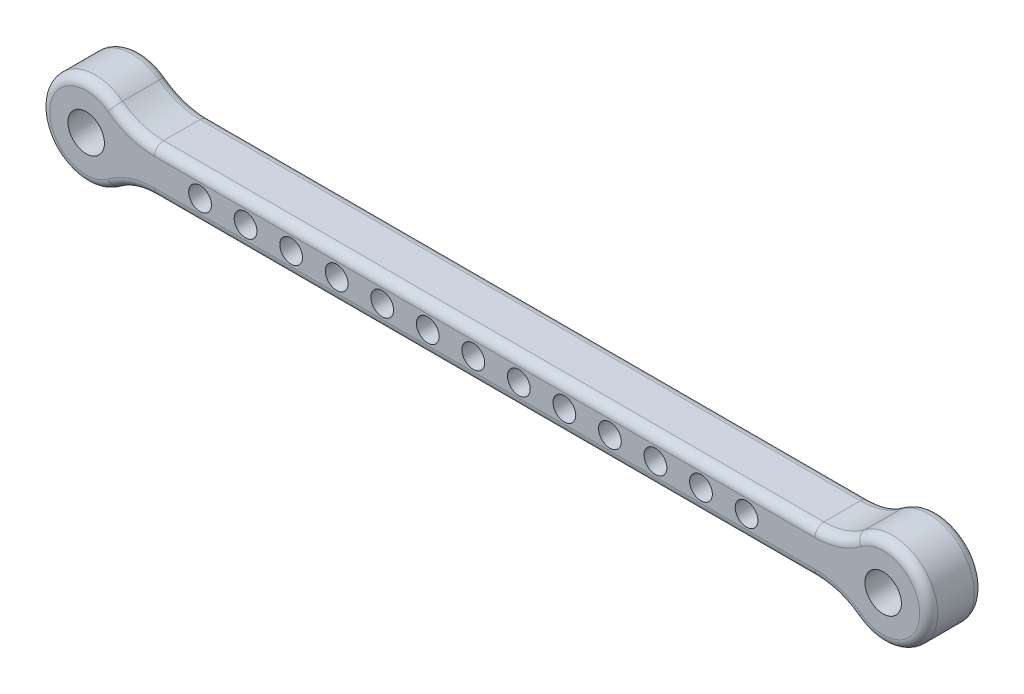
ISO-10303-21;
HEADER;
FILE_DESCRIPTION(('STEP AP214'),'2;1');
FILE_NAME('part.step','',(''),(''),'','','');
FILE_SCHEMA(('AUTOMOTIVE_DESIGN { 1 0 10303 214 1 1 1 1 }'));
ENDSEC;
DATA;
#1=APPLICATION_CONTEXT('core data for automotive mechanical design processes');
#2=APPLICATION_PROTOCOL_DEFINITION('international standard','automotive_design',2000,#1);
#3=PRODUCT_CONTEXT('',#1,'mechanical');
#4=PRODUCT('Part','Part','',(#3));
#5=PRODUCT_RELATED_PRODUCT_CATEGORY('part','',(#4));
#6=PRODUCT_DEFINITION_FORMATION('','',#4);
#7=PRODUCT_DEFINITION_CONTEXT('part definition',#1,'design');
#8=PRODUCT_DEFINITION('design','',#6,#7);
#9=PRODUCT_DEFINITION_SHAPE('','',#8);
#10=(LENGTH_UNIT() NAMED_UNIT(*) SI_UNIT(.MILLI.,.METRE.));
#11=(NAMED_UNIT(*) PLANE_ANGLE_UNIT() SI_UNIT($,.RADIAN.));
#12=(NAMED_UNIT(*) SI_UNIT($,.STERADIAN.) SOLID_ANGLE_UNIT());
#13=UNCERTAINTY_MEASURE_WITH_UNIT(LENGTH_MEASURE(1.E-05),#10,'distance_accuracy_value','');
#14=(GEOMETRIC_REPRESENTATION_CONTEXT(3) GLOBAL_UNCERTAINTY_ASSIGNED_CONTEXT((#13)) GLOBAL_UNIT_ASSIGNED_CONTEXT((#10,
#11,#12)) REPRESENTATION_CONTEXT('',''));
#15=CARTESIAN_POINT('',(0.,0.,0.));
#16=DIRECTION('',(0.,0.,1.));
#17=DIRECTION('',(1.,0.,0.));
#18=AXIS2_PLACEMENT_3D('',#15,#16,#17);
#19=CARTESIAN_POINT('',(-15.,20.,12.));
#20=DIRECTION('',(0.,0.,1.));
#21=DIRECTION('',(1.,0.,0.));
#22=AXIS2_PLACEMENT_3D('',#19,#20,#21);
#23=PLANE('',#22);
#24=DIRECTION('',(-1.,0.,0.));
#25=VECTOR('',#24,1.);
#26=CARTESIAN_POINT('',(-160.,3.,12.));
#27=LINE('',#26,#25);
#28=CARTESIAN_POINT('',(-15.,3.,12.));
#29=VERTEX_POINT('',#28);
#30=CARTESIAN_POINT('',(-160.,3.,12.));
#31=VERTEX_POINT('',#30);
#32=EDGE_CURVE('E51',#29,#31,#27,.T.);
#33=ORIENTED_EDGE('',*,*,#32,.T.);
#34=CARTESIAN_POINT('',(-160.,20.,12.));
#35=DIRECTION('',(0.,0.,1.));
#36=DIRECTION('',(1.,0.,0.));
#37=AXIS2_PLACEMENT_3D('',#34,#35,#36);
#38=CIRCLE('',#37,17.);
#39=CARTESIAN_POINT('',(-170.2,6.40000000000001,12.));
#40=VERTEX_POINT('',#39);
#41=EDGE_CURVE('E158',#31,#40,#38,.F.);
#42=ORIENTED_EDGE('',*,*,#41,.T.);
#43=CARTESIAN_POINT('',(-175.,0.,12.));
#44=DIRECTION('',(0.,0.,1.));
#45=DIRECTION('',(1.,0.,0.));
#46=AXIS2_PLACEMENT_3D('',#43,#44,#45);
#47=CIRCLE('',#46,8.00000000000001);
#48=CARTESIAN_POINT('',(-170.2,-6.40000000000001,12.));
#49=VERTEX_POINT('',#48);
#50=EDGE_CURVE('E182',#40,#49,#47,.T.);
#51=ORIENTED_EDGE('',*,*,#50,.T.);
#52=CARTESIAN_POINT('',(-160.,-20.,12.));
#53=DIRECTION('',(0.,0.,1.));
#54=DIRECTION('',(1.,0.,0.));
#55=AXIS2_PLACEMENT_3D('',#52,#53,#54);
#56=CIRCLE('',#55,17.);
#57=CARTESIAN_POINT('',(-160.,-3.,12.));
#58=VERTEX_POINT('',#57);
#59=EDGE_CURVE('E393',#49,#58,#56,.F.);
#60=ORIENTED_EDGE('',*,*,#59,.T.);
#61=DIRECTION('',(1.,0.,0.));
#62=VECTOR('',#61,1.);
#63=CARTESIAN_POINT('',(-15.,-3.,12.));
#64=LINE('',#63,#62);
#65=CARTESIAN_POINT('',(-15.,-3.,12.));
#66=VERTEX_POINT('',#65);
#67=EDGE_CURVE('E395',#58,#66,#64,.T.);
#68=ORIENTED_EDGE('',*,*,#67,.T.);
#69=CARTESIAN_POINT('',(-15.,-20.,12.));
#70=DIRECTION('',(0.,0.,1.));
#71=DIRECTION('',(1.,0.,0.));
#72=AXIS2_PLACEMENT_3D('',#69,#70,#71);
#73=CIRCLE('',#72,17.);
#74=CARTESIAN_POINT('',(-4.8,-6.4,12.));
#75=VERTEX_POINT('',#74);
#76=EDGE_CURVE('E397',#66,#75,#73,.F.);
#77=ORIENTED_EDGE('',*,*,#76,.T.);
#78=CARTESIAN_POINT('',(0.,0.,12.));
#79=DIRECTION('',(0.,0.,1.));
#80=DIRECTION('',(1.,0.,0.));
#81=AXIS2_PLACEMENT_3D('',#78,#79,#80);
#82=CIRCLE('',#81,8.);
#83=CARTESIAN_POINT('',(-4.8,6.4,12.));
#84=VERTEX_POINT('',#83);
#85=EDGE_CURVE('E399',#75,#84,#82,.T.);
#86=ORIENTED_EDGE('',*,*,#85,.T.);
#87=CARTESIAN_POINT('',(-15.,20.,12.));
#88=DIRECTION('',(0.,0.,1.));
#89=DIRECTION('',(1.,0.,0.));
#90=AXIS2_PLACEMENT_3D('',#87,#88,#89);
#91=CIRCLE('',#90,17.);
#92=EDGE_CURVE('E56',#84,#29,#91,.F.);
#93=ORIENTED_EDGE('',*,*,#92,.T.);
#94=EDGE_LOOP('',(#33,#42,#51,#60,#68,#77,#86,#93));
#95=FACE_BOUND('',#94,.T.);
#96=CARTESIAN_POINT('',(-40.,0.,12.));
#97=DIRECTION('',(0.,0.,1.));
#98=DIRECTION('',(1.,0.,0.));
#99=AXIS2_PLACEMENT_3D('',#96,#97,#98);
#100=CIRCLE('',#99,2.5);
#101=CARTESIAN_POINT('',(-37.5,0.,12.));
#102=VERTEX_POINT('',#101);
#103=EDGE_CURVE('E251',#102,#102,#100,.T.);
#104=ORIENTED_EDGE('',*,*,#103,.F.);
#105=EDGE_LOOP('',(#104));
#106=FACE_BOUND('',#105,.T.);
#107=CARTESIAN_POINT('',(-60.,0.,12.));
#108=DIRECTION('',(0.,0.,1.));
#109=DIRECTION('',(1.,0.,0.));
#110=AXIS2_PLACEMENT_3D('',#107,#108,#109);
#111=CIRCLE('',#110,2.5);
#112=CARTESIAN_POINT('',(-57.5,0.,12.));
#113=VERTEX_POINT('',#112);
#114=EDGE_CURVE('E263',#113,#113,#111,.T.);
#115=ORIENTED_EDGE('',*,*,#114,.F.);
#116=EDGE_LOOP('',(#115));
#117=FACE_BOUND('',#116,.T.);
#118=CARTESIAN_POINT('',(-80.,0.,12.));
#119=DIRECTION('',(0.,0.,1.));
#120=DIRECTION('',(1.,0.,0.));
#121=AXIS2_PLACEMENT_3D('',#118,#119,#120);
#122=CIRCLE('',#121,2.5);
#123=CARTESIAN_POINT('',(-77.5,0.,12.));
#124=VERTEX_POINT('',#123);
#125=EDGE_CURVE('E275',#124,#124,#122,.T.);
#126=ORIENTED_EDGE('',*,*,#125,.F.);
#127=EDGE_LOOP('',(#126));
#128=FACE_BOUND('',#127,.T.);
#129=CARTESIAN_POINT('',(-100.,0.,12.));
#130=DIRECTION('',(0.,0.,1.));
#131=DIRECTION('',(1.,0.,0.));
#132=AXIS2_PLACEMENT_3D('',#129,#130,#131);
#133=CIRCLE('',#132,2.5);
#134=CARTESIAN_POINT('',(-97.5,0.,12.));
#135=VERTEX_POINT('',#134);
#136=EDGE_CURVE('E287',#135,#135,#133,.T.);
#137=ORIENTED_EDGE('',*,*,#136,.F.);
#138=EDGE_LOOP('',(#137));
#139=FACE_BOUND('',#138,.T.);
#140=CARTESIAN_POINT('',(-120.,0.,12.));
#141=DIRECTION('',(0.,0.,1.));
#142=DIRECTION('',(1.,0.,0.));
#143=AXIS2_PLACEMENT_3D('',#140,#141,#142);
#144=CIRCLE('',#143,2.5);
#145=CARTESIAN_POINT('',(-117.5,0.,12.));
#146=VERTEX_POINT('',#145);
#147=EDGE_CURVE('E299',#146,#146,#144,.T.);
#148=ORIENTED_EDGE('',*,*,#147,.F.);
#149=EDGE_LOOP('',(#148));
#150=FACE_BOUND('',#149,.T.);
#151=CARTESIAN_POINT('',(-140.,0.,12.));
#152=DIRECTION('',(0.,0.,1.));
#153=DIRECTION('',(1.,0.,0.));
#154=AXIS2_PLACEMENT_3D('',#151,#152,#153);
#155=CIRCLE('',#154,2.5);
#156=CARTESIAN_POINT('',(-137.5,0.,12.));
#157=VERTEX_POINT('',#156);
#158=EDGE_CURVE('E311',#157,#157,#155,.T.);
#159=ORIENTED_EDGE('',*,*,#158,.F.);
#160=EDGE_LOOP('',(#159));
#161=FACE_BOUND('',#160,.T.);
#162=CARTESIAN_POINT('',(0.,0.,12.));
#163=DIRECTION('',(0.,0.,1.));
#164=DIRECTION('',(1.,0.,0.));
#165=AXIS2_PLACEMENT_3D('',#162,#163,#164);
#166=CIRCLE('',#165,4.);
#167=CARTESIAN_POINT('',(4.,0.,12.));
#168=VERTEX_POINT('',#167);
#169=EDGE_CURVE('E323',#168,#168,#166,.T.);
#170=ORIENTED_EDGE('',*,*,#169,.F.);
#171=EDGE_LOOP('',(#170));
#172=FACE_BOUND('',#171,.T.);
#173=CARTESIAN_POINT('',(-175.,0.,12.));
#174=DIRECTION('',(0.,0.,1.));
#175=DIRECTION('',(1.,0.,0.));
#176=AXIS2_PLACEMENT_3D('',#173,#174,#175);
#177=CIRCLE('',#176,3.99999999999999);
#178=CARTESIAN_POINT('',(-171.,0.,12.));
#179=VERTEX_POINT('',#178);
#180=EDGE_CURVE('E329',#179,#179,#177,.T.);
#181=ORIENTED_EDGE('',*,*,#180,.F.);
#182=EDGE_LOOP('',(#181));
#183=FACE_BOUND('',#182,.T.);
#184=CARTESIAN_POINT('',(-150.,0.,12.));
#185=DIRECTION('',(0.,0.,1.));
#186=DIRECTION('',(1.,0.,0.));
#187=AXIS2_PLACEMENT_3D('',#184,#185,#186);
#188=CIRCLE('',#187,2.5);
#189=CARTESIAN_POINT('',(-147.5,0.,12.));
#190=VERTEX_POINT('',#189);
#191=EDGE_CURVE('E317',#190,#190,#188,.T.);
#192=ORIENTED_EDGE('',*,*,#191,.F.);
#193=EDGE_LOOP('',(#192));
#194=FACE_BOUND('',#193,.T.);
#195=CARTESIAN_POINT('',(-130.,0.,12.));
#196=DIRECTION('',(0.,0.,1.));
#197=DIRECTION('',(1.,0.,0.));
#198=AXIS2_PLACEMENT_3D('',#195,#196,#197);
#199=CIRCLE('',#198,2.5);
#200=CARTESIAN_POINT('',(-127.5,0.,12.));
#201=VERTEX_POINT('',#200);
#202=EDGE_CURVE('E305',#201,#201,#199,.T.);
#203=ORIENTED_EDGE('',*,*,#202,.F.);
#204=EDGE_LOOP('',(#203));
#205=FACE_BOUND('',#204,.T.);
#206=CARTESIAN_POINT('',(-110.,0.,12.));
#207=DIRECTION('',(0.,0.,1.));
#208=DIRECTION('',(1.,0.,0.));
#209=AXIS2_PLACEMENT_3D('',#206,#207,#208);
#210=CIRCLE('',#209,2.5);
#211=CARTESIAN_POINT('',(-107.5,0.,12.));
#212=VERTEX_POINT('',#211);
#213=EDGE_CURVE('E293',#212,#212,#210,.T.);
#214=ORIENTED_EDGE('',*,*,#213,.F.);
#215=EDGE_LOOP('',(#214));
#216=FACE_BOUND('',#215,.T.);
#217=CARTESIAN_POINT('',(-90.,0.,12.));
#218=DIRECTION('',(0.,0.,1.));
#219=DIRECTION('',(1.,0.,0.));
#220=AXIS2_PLACEMENT_3D('',#217,#218,#219);
#221=CIRCLE('',#220,2.5);
#222=CARTESIAN_POINT('',(-87.5,0.,12.));
#223=VERTEX_POINT('',#222);
#224=EDGE_CURVE('E281',#223,#223,#221,.T.);
#225=ORIENTED_EDGE('',*,*,#224,.F.);
#226=EDGE_LOOP('',(#225));
#227=FACE_BOUND('',#226,.T.);
#228=CARTESIAN_POINT('',(-70.,0.,12.));
#229=DIRECTION('',(0.,0.,1.));
#230=DIRECTION('',(1.,0.,0.));
#231=AXIS2_PLACEMENT_3D('',#228,#229,#230);
#232=CIRCLE('',#231,2.5);
#233=CARTESIAN_POINT('',(-67.5,0.,12.));
#234=VERTEX_POINT('',#233);
#235=EDGE_CURVE('E269',#234,#234,#232,.T.);
#236=ORIENTED_EDGE('',*,*,#235,.F.);
#237=EDGE_LOOP('',(#236));
#238=FACE_BOUND('',#237,.T.);
#239=CARTESIAN_POINT('',(-50.,0.,12.));
#240=DIRECTION('',(0.,0.,1.));
#241=DIRECTION('',(1.,0.,0.));
#242=AXIS2_PLACEMENT_3D('',#239,#240,#241);
#243=CIRCLE('',#242,2.5);
#244=CARTESIAN_POINT('',(-47.5,0.,12.));
#245=VERTEX_POINT('',#244);
#246=EDGE_CURVE('E257',#245,#245,#243,.T.);
#247=ORIENTED_EDGE('',*,*,#246,.F.);
#248=EDGE_LOOP('',(#247));
#249=FACE_BOUND('',#248,.T.);
#250=CARTESIAN_POINT('',(-30.,0.,12.));
#251=DIRECTION('',(0.,0.,1.));
#252=DIRECTION('',(1.,0.,0.));
#253=AXIS2_PLACEMENT_3D('',#250,#251,#252);
#254=CIRCLE('',#253,2.5);
#255=CARTESIAN_POINT('',(-27.5,0.,12.));
#256=VERTEX_POINT('',#255);
#257=EDGE_CURVE('E243',#256,#256,#254,.T.);
#258=ORIENTED_EDGE('',*,*,#257,.F.);
#259=EDGE_LOOP('',(#258));
#260=FACE_BOUND('',#259,.T.);
#261=ADVANCED_FACE('F34',(#95,#106,#117,#128,#139,#150,#161,#172,#183,#194,#205,#216,#227,#238,
#249,#260),#23,.T.);
#262=CARTESIAN_POINT('',(-15.,20.,0.));
#263=DIRECTION('',(0.,0.,1.));
#264=DIRECTION('',(1.,0.,0.));
#265=AXIS2_PLACEMENT_3D('',#262,#263,#264);
#266=PLANE('',#265);
#267=CARTESIAN_POINT('',(-175.,0.,0.));
#268=DIRECTION('',(0.,0.,1.));
#269=DIRECTION('',(1.,0.,0.));
#270=AXIS2_PLACEMENT_3D('',#267,#268,#269);
#271=CIRCLE('',#270,8.00000000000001);
#272=CARTESIAN_POINT('',(-170.2,-6.40000000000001,0.));
#273=VERTEX_POINT('',#272);
#274=CARTESIAN_POINT('',(-170.2,6.40000000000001,0.));
#275=VERTEX_POINT('',#274);
#276=EDGE_CURVE('E351',#273,#275,#271,.F.);
#277=ORIENTED_EDGE('',*,*,#276,.T.);
#278=CARTESIAN_POINT('',(-160.,20.,0.));
#279=DIRECTION('',(0.,0.,1.));
#280=DIRECTION('',(1.,0.,0.));
#281=AXIS2_PLACEMENT_3D('',#278,#279,#280);
#282=CIRCLE('',#281,17.);
#283=CARTESIAN_POINT('',(-160.,3.,0.));
#284=VERTEX_POINT('',#283);
#285=EDGE_CURVE('E365',#275,#284,#282,.T.);
#286=ORIENTED_EDGE('',*,*,#285,.T.);
#287=DIRECTION('',(-1.,0.,0.));
#288=VECTOR('',#287,1.);
#289=CARTESIAN_POINT('',(-15.,3.,0.));
#290=LINE('',#289,#288);
#291=CARTESIAN_POINT('',(-15.,3.,0.));
#292=VERTEX_POINT('',#291);
#293=EDGE_CURVE('E363',#284,#292,#290,.F.);
#294=ORIENTED_EDGE('',*,*,#293,.T.);
#295=CARTESIAN_POINT('',(-15.,20.,0.));
#296=DIRECTION('',(0.,0.,1.));
#297=DIRECTION('',(1.,0.,0.));
#298=AXIS2_PLACEMENT_3D('',#295,#296,#297);
#299=CIRCLE('',#298,17.);
#300=CARTESIAN_POINT('',(-4.8,6.4,0.));
#301=VERTEX_POINT('',#300);
#302=EDGE_CURVE('E361',#292,#301,#299,.T.);
#303=ORIENTED_EDGE('',*,*,#302,.T.);
#304=CARTESIAN_POINT('',(0.,0.,0.));
#305=DIRECTION('',(0.,0.,1.));
#306=DIRECTION('',(1.,0.,0.));
#307=AXIS2_PLACEMENT_3D('',#304,#305,#306);
#308=CIRCLE('',#307,8.);
#309=CARTESIAN_POINT('',(-4.8,-6.4,0.));
#310=VERTEX_POINT('',#309);
#311=EDGE_CURVE('E359',#301,#310,#308,.F.);
#312=ORIENTED_EDGE('',*,*,#311,.T.);
#313=CARTESIAN_POINT('',(-15.,-20.,0.));
#314=DIRECTION('',(0.,0.,1.));
#315=DIRECTION('',(1.,0.,0.));
#316=AXIS2_PLACEMENT_3D('',#313,#314,#315);
#317=CIRCLE('',#316,17.);
#318=CARTESIAN_POINT('',(-15.,-3.,0.));
#319=VERTEX_POINT('',#318);
#320=EDGE_CURVE('E357',#310,#319,#317,.T.);
#321=ORIENTED_EDGE('',*,*,#320,.T.);
#322=DIRECTION('',(1.,0.,0.));
#323=VECTOR('',#322,1.);
#324=CARTESIAN_POINT('',(-15.,-3.,0.));
#325=LINE('',#324,#323);
#326=CARTESIAN_POINT('',(-160.,-3.,0.));
#327=VERTEX_POINT('',#326);
#328=EDGE_CURVE('E355',#319,#327,#325,.F.);
#329=ORIENTED_EDGE('',*,*,#328,.T.);
#330=CARTESIAN_POINT('',(-160.,-20.,0.));
#331=DIRECTION('',(0.,0.,1.));
#332=DIRECTION('',(1.,0.,0.));
#333=AXIS2_PLACEMENT_3D('',#330,#331,#332);
#334=CIRCLE('',#333,17.);
#335=EDGE_CURVE('E353',#327,#273,#334,.T.);
#336=ORIENTED_EDGE('',*,*,#335,.T.);
#337=EDGE_LOOP('',(#277,#286,#294,#303,#312,#321,#329,#336));
#338=FACE_BOUND('',#337,.T.);
#339=CARTESIAN_POINT('',(-175.,0.,0.));
#340=DIRECTION('',(0.,0.,1.));
#341=DIRECTION('',(1.,0.,0.));
#342=AXIS2_PLACEMENT_3D('',#339,#340,#341);
#343=CIRCLE('',#342,3.99999999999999);
#344=CARTESIAN_POINT('',(-171.,0.,0.));
#345=VERTEX_POINT('',#344);
#346=EDGE_CURVE('E326',#345,#345,#343,.T.);
#347=ORIENTED_EDGE('',*,*,#346,.T.);
#348=EDGE_LOOP('',(#347));
#349=FACE_BOUND('',#348,.T.);
#350=CARTESIAN_POINT('',(0.,0.,0.));
#351=DIRECTION('',(0.,0.,1.));
#352=DIRECTION('',(1.,0.,0.));
#353=AXIS2_PLACEMENT_3D('',#350,#351,#352);
#354=CIRCLE('',#353,4.);
#355=CARTESIAN_POINT('',(4.,0.,0.));
#356=VERTEX_POINT('',#355);
#357=EDGE_CURVE('E320',#356,#356,#354,.T.);
#358=ORIENTED_EDGE('',*,*,#357,.T.);
#359=EDGE_LOOP('',(#358));
#360=FACE_BOUND('',#359,.T.);
#361=CARTESIAN_POINT('',(-150.,0.,0.));
#362=DIRECTION('',(0.,0.,1.));
#363=DIRECTION('',(1.,0.,0.));
#364=AXIS2_PLACEMENT_3D('',#361,#362,#363);
#365=CIRCLE('',#364,2.5);
#366=CARTESIAN_POINT('',(-147.5,0.,0.));
#367=VERTEX_POINT('',#366);
#368=EDGE_CURVE('E314',#367,#367,#365,.T.);
#369=ORIENTED_EDGE('',*,*,#368,.T.);
#370=EDGE_LOOP('',(#369));
#371=FACE_BOUND('',#370,.T.);
#372=CARTESIAN_POINT('',(-140.,0.,0.));
#373=DIRECTION('',(0.,0.,1.));
#374=DIRECTION('',(1.,0.,0.));
#375=AXIS2_PLACEMENT_3D('',#372,#373,#374);
#376=CIRCLE('',#375,2.5);
#377=CARTESIAN_POINT('',(-137.5,0.,0.));
#378=VERTEX_POINT('',#377);
#379=EDGE_CURVE('E308',#378,#378,#376,.T.);
#380=ORIENTED_EDGE('',*,*,#379,.T.);
#381=EDGE_LOOP('',(#380));
#382=FACE_BOUND('',#381,.T.);
#383=CARTESIAN_POINT('',(-130.,0.,0.));
#384=DIRECTION('',(0.,0.,1.));
#385=DIRECTION('',(1.,0.,0.));
#386=AXIS2_PLACEMENT_3D('',#383,#384,#385);
#387=CIRCLE('',#386,2.5);
#388=CARTESIAN_POINT('',(-127.5,0.,0.));
#389=VERTEX_POINT('',#388);
#390=EDGE_CURVE('E302',#389,#389,#387,.T.);
#391=ORIENTED_EDGE('',*,*,#390,.T.);
#392=EDGE_LOOP('',(#391));
#393=FACE_BOUND('',#392,.T.);
#394=CARTESIAN_POINT('',(-120.,0.,0.));
#395=DIRECTION('',(0.,0.,1.));
#396=DIRECTION('',(1.,0.,0.));
#397=AXIS2_PLACEMENT_3D('',#394,#395,#396);
#398=CIRCLE('',#397,2.5);
#399=CARTESIAN_POINT('',(-117.5,0.,0.));
#400=VERTEX_POINT('',#399);
#401=EDGE_CURVE('E296',#400,#400,#398,.T.);
#402=ORIENTED_EDGE('',*,*,#401,.T.);
#403=EDGE_LOOP('',(#402));
#404=FACE_BOUND('',#403,.T.);
#405=CARTESIAN_POINT('',(-110.,0.,0.));
#406=DIRECTION('',(0.,0.,1.));
#407=DIRECTION('',(1.,0.,0.));
#408=AXIS2_PLACEMENT_3D('',#405,#406,#407);
#409=CIRCLE('',#408,2.5);
#410=CARTESIAN_POINT('',(-107.5,0.,0.));
#411=VERTEX_POINT('',#410);
#412=EDGE_CURVE('E290',#411,#411,#409,.T.);
#413=ORIENTED_EDGE('',*,*,#412,.T.);
#414=EDGE_LOOP('',(#413));
#415=FACE_BOUND('',#414,.T.);
#416=CARTESIAN_POINT('',(-100.,0.,0.));
#417=DIRECTION('',(0.,0.,1.));
#418=DIRECTION('',(1.,0.,0.));
#419=AXIS2_PLACEMENT_3D('',#416,#417,#418);
#420=CIRCLE('',#419,2.5);
#421=CARTESIAN_POINT('',(-97.5,0.,0.));
#422=VERTEX_POINT('',#421);
#423=EDGE_CURVE('E284',#422,#422,#420,.T.);
#424=ORIENTED_EDGE('',*,*,#423,.T.);
#425=EDGE_LOOP('',(#424));
#426=FACE_BOUND('',#425,.T.);
#427=CARTESIAN_POINT('',(-90.,0.,0.));
#428=DIRECTION('',(0.,0.,1.));
#429=DIRECTION('',(1.,0.,0.));
#430=AXIS2_PLACEMENT_3D('',#427,#428,#429);
#431=CIRCLE('',#430,2.5);
#432=CARTESIAN_POINT('',(-87.5,0.,0.));
#433=VERTEX_POINT('',#432);
#434=EDGE_CURVE('E278',#433,#433,#431,.T.);
#435=ORIENTED_EDGE('',*,*,#434,.T.);
#436=EDGE_LOOP('',(#435));
#437=FACE_BOUND('',#436,.T.);
#438=CARTESIAN_POINT('',(-80.,0.,0.));
#439=DIRECTION('',(0.,0.,1.));
#440=DIRECTION('',(1.,0.,0.));
#441=AXIS2_PLACEMENT_3D('',#438,#439,#440);
#442=CIRCLE('',#441,2.5);
#443=CARTESIAN_POINT('',(-77.5,0.,0.));
#444=VERTEX_POINT('',#443);
#445=EDGE_CURVE('E272',#444,#444,#442,.T.);
#446=ORIENTED_EDGE('',*,*,#445,.T.);
#447=EDGE_LOOP('',(#446));
#448=FACE_BOUND('',#447,.T.);
#449=CARTESIAN_POINT('',(-70.,0.,0.));
#450=DIRECTION('',(0.,0.,1.));
#451=DIRECTION('',(1.,0.,0.));
#452=AXIS2_PLACEMENT_3D('',#449,#450,#451);
#453=CIRCLE('',#452,2.5);
#454=CARTESIAN_POINT('',(-67.5,0.,0.));
#455=VERTEX_POINT('',#454);
#456=EDGE_CURVE('E266',#455,#455,#453,.T.);
#457=ORIENTED_EDGE('',*,*,#456,.T.);
#458=EDGE_LOOP('',(#457));
#459=FACE_BOUND('',#458,.T.);
#460=CARTESIAN_POINT('',(-60.,0.,0.));
#461=DIRECTION('',(0.,0.,1.));
#462=DIRECTION('',(1.,0.,0.));
#463=AXIS2_PLACEMENT_3D('',#460,#461,#462);
#464=CIRCLE('',#463,2.5);
#465=CARTESIAN_POINT('',(-57.5,0.,0.));
#466=VERTEX_POINT('',#465);
#467=EDGE_CURVE('E260',#466,#466,#464,.T.);
#468=ORIENTED_EDGE('',*,*,#467,.T.);
#469=EDGE_LOOP('',(#468));
#470=FACE_BOUND('',#469,.T.);
#471=CARTESIAN_POINT('',(-50.,0.,0.));
#472=DIRECTION('',(0.,0.,1.));
#473=DIRECTION('',(1.,0.,0.));
#474=AXIS2_PLACEMENT_3D('',#471,#472,#473);
#475=CIRCLE('',#474,2.5);
#476=CARTESIAN_POINT('',(-47.5,0.,0.));
#477=VERTEX_POINT('',#476);
#478=EDGE_CURVE('E254',#477,#477,#475,.T.);
#479=ORIENTED_EDGE('',*,*,#478,.T.);
#480=EDGE_LOOP('',(#479));
#481=FACE_BOUND('',#480,.T.);
#482=CARTESIAN_POINT('',(-40.,0.,0.));
#483=DIRECTION('',(0.,0.,1.));
#484=DIRECTION('',(1.,0.,0.));
#485=AXIS2_PLACEMENT_3D('',#482,#483,#484);
#486=CIRCLE('',#485,2.5);
#487=CARTESIAN_POINT('',(-37.5,0.,0.));
#488=VERTEX_POINT('',#487);
#489=EDGE_CURVE('E248',#488,#488,#486,.T.);
#490=ORIENTED_EDGE('',*,*,#489,.T.);
#491=EDGE_LOOP('',(#490));
#492=FACE_BOUND('',#491,.T.);
#493=CARTESIAN_POINT('',(-30.,0.,0.));
#494=DIRECTION('',(0.,0.,1.));
#495=DIRECTION('',(1.,0.,0.));
#496=AXIS2_PLACEMENT_3D('',#493,#494,#495);
#497=CIRCLE('',#496,2.5);
#498=CARTESIAN_POINT('',(-27.5,0.,0.));
#499=VERTEX_POINT('',#498);
#500=EDGE_CURVE('E237',#499,#499,#497,.T.);
#501=ORIENTED_EDGE('',*,*,#500,.T.);
#502=EDGE_LOOP('',(#501));
#503=FACE_BOUND('',#502,.T.);
#504=ADVANCED_FACE('F449',(#338,#349,#360,#371,#382,#393,#404,#415,#426,#437,#448,#459,#470,
#481,#492,#503),#266,.F.);
#505=CARTESIAN_POINT('',(-15.,20.,12.));
#506=DIRECTION('',(0.,0.,-1.));
#507=DIRECTION('',(-1.,0.,0.));
#508=AXIS2_PLACEMENT_3D('',#505,#506,#507);
#509=CYLINDRICAL_SURFACE('',#508,15.);
#510=DIRECTION('',(0.,0.,-1.));
#511=VECTOR('',#510,1.);
#512=CARTESIAN_POINT('',(-6.,8.,12.));
#513=LINE('',#512,#511);
#514=CARTESIAN_POINT('',(-6.,8.,10.));
#515=VERTEX_POINT('',#514);
#516=CARTESIAN_POINT('',(-6.,8.,2.));
#517=VERTEX_POINT('',#516);
#518=EDGE_CURVE('E332',#515,#517,#513,.T.);
#519=ORIENTED_EDGE('',*,*,#518,.T.);
#520=CARTESIAN_POINT('',(-15.,20.,2.));
#521=DIRECTION('',(0.,0.,1.));
#522=DIRECTION('',(1.,0.,0.));
#523=AXIS2_PLACEMENT_3D('',#520,#521,#522);
#524=CIRCLE('',#523,15.);
#525=CARTESIAN_POINT('',(-15.,5.,2.));
#526=VERTEX_POINT('',#525);
#527=EDGE_CURVE('E374',#517,#526,#524,.F.);
#528=ORIENTED_EDGE('',*,*,#527,.T.);
#529=DIRECTION('',(0.,0.,-1.));
#530=VECTOR('',#529,1.);
#531=CARTESIAN_POINT('',(-15.,5.,12.));
#532=LINE('',#531,#530);
#533=CARTESIAN_POINT('',(-15.,5.,10.));
#534=VERTEX_POINT('',#533);
#535=EDGE_CURVE('E179',#534,#526,#532,.T.);
#536=ORIENTED_EDGE('',*,*,#535,.F.);
#537=CARTESIAN_POINT('',(-15.,20.,10.));
#538=DIRECTION('',(0.,0.,1.));
#539=DIRECTION('',(1.,0.,0.));
#540=AXIS2_PLACEMENT_3D('',#537,#538,#539);
#541=CIRCLE('',#540,15.);
#542=EDGE_CURVE('E372',#534,#515,#541,.T.);
#543=ORIENTED_EDGE('',*,*,#542,.T.);
#544=EDGE_LOOP('',(#519,#528,#536,#543));
#545=FACE_BOUND('',#544,.T.);
#546=ADVANCED_FACE('F425',(#545),#509,.F.);
#547=CARTESIAN_POINT('',(-15.,5.,12.));
#548=DIRECTION('',(0.,-1.,0.));
#549=DIRECTION('',(0.,0.,-1.));
#550=AXIS2_PLACEMENT_3D('',#547,#548,#549);
#551=PLANE('',#550);
#552=ORIENTED_EDGE('',*,*,#535,.T.);
#553=DIRECTION('',(-1.,0.,0.));
#554=VECTOR('',#553,1.);
#555=CARTESIAN_POINT('',(-15.,5.,2.));
#556=LINE('',#555,#554);
#557=CARTESIAN_POINT('',(-160.,5.,2.));
#558=VERTEX_POINT('',#557);
#559=EDGE_CURVE('E370',#526,#558,#556,.T.);
#560=ORIENTED_EDGE('',*,*,#559,.T.);
#561=DIRECTION('',(0.,0.,-1.));
#562=VECTOR('',#561,1.);
#563=CARTESIAN_POINT('',(-160.,5.,12.));
#564=LINE('',#563,#562);
#565=CARTESIAN_POINT('',(-160.,5.,10.));
#566=VERTEX_POINT('',#565);
#567=EDGE_CURVE('E170',#566,#558,#564,.T.);
#568=ORIENTED_EDGE('',*,*,#567,.F.);
#569=DIRECTION('',(-1.,0.,0.));
#570=VECTOR('',#569,1.);
#571=CARTESIAN_POINT('',(-15.,5.,10.));
#572=LINE('',#571,#570);
#573=EDGE_CURVE('E368',#566,#534,#572,.F.);
#574=ORIENTED_EDGE('',*,*,#573,.T.);
#575=EDGE_LOOP('',(#552,#560,#568,#574));
#576=FACE_BOUND('',#575,.T.);
#577=ADVANCED_FACE('F422',(#576),#551,.F.);
#578=CARTESIAN_POINT('',(-160.,20.,12.));
#579=DIRECTION('',(0.,0.,-1.));
#580=DIRECTION('',(-1.,0.,0.));
#581=AXIS2_PLACEMENT_3D('',#578,#579,#580);
#582=CYLINDRICAL_SURFACE('',#581,15.);
#583=ORIENTED_EDGE('',*,*,#567,.T.);
#584=CARTESIAN_POINT('',(-160.,20.,2.));
#585=DIRECTION('',(0.,0.,1.));
#586=DIRECTION('',(1.,0.,0.));
#587=AXIS2_PLACEMENT_3D('',#584,#585,#586);
#588=CIRCLE('',#587,15.);
#589=CARTESIAN_POINT('',(-169.,8.00000000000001,2.));
#590=VERTEX_POINT('',#589);
#591=EDGE_CURVE('E169',#558,#590,#588,.F.);
#592=ORIENTED_EDGE('',*,*,#591,.T.);
#593=DIRECTION('',(0.,0.,-1.));
#594=VECTOR('',#593,1.);
#595=CARTESIAN_POINT('',(-169.,8.00000000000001,12.));
#596=LINE('',#595,#594);
#597=CARTESIAN_POINT('',(-169.,8.00000000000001,10.));
#598=VERTEX_POINT('',#597);
#599=EDGE_CURVE('E151',#598,#590,#596,.T.);
#600=ORIENTED_EDGE('',*,*,#599,.F.);
#601=CARTESIAN_POINT('',(-160.,20.,10.));
#602=DIRECTION('',(0.,0.,1.));
#603=DIRECTION('',(1.,0.,0.));
#604=AXIS2_PLACEMENT_3D('',#601,#602,#603);
#605=CIRCLE('',#604,15.);
#606=EDGE_CURVE('E166',#598,#566,#605,.T.);
#607=ORIENTED_EDGE('',*,*,#606,.T.);
#608=EDGE_LOOP('',(#583,#592,#600,#607));
#609=FACE_BOUND('',#608,.T.);
#610=ADVANCED_FACE('F165',(#609),#582,.F.);
#611=CARTESIAN_POINT('',(-175.,0.,12.));
#612=DIRECTION('',(0.,0.,-1.));
#613=DIRECTION('',(-1.,0.,0.));
#614=AXIS2_PLACEMENT_3D('',#611,#612,#613);
#615=CYLINDRICAL_SURFACE('',#614,10.);
#616=ORIENTED_EDGE('',*,*,#599,.T.);
#617=CARTESIAN_POINT('',(-175.,0.,2.));
#618=DIRECTION('',(0.,0.,1.));
#619=DIRECTION('',(1.,0.,0.));
#620=AXIS2_PLACEMENT_3D('',#617,#618,#619);
#621=CIRCLE('',#620,10.);
#622=CARTESIAN_POINT('',(-169.,-8.00000000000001,2.));
#623=VERTEX_POINT('',#622);
#624=EDGE_CURVE('E11',#590,#623,#621,.T.);
#625=ORIENTED_EDGE('',*,*,#624,.T.);
#626=DIRECTION('',(0.,0.,-1.));
#627=VECTOR('',#626,1.);
#628=CARTESIAN_POINT('',(-169.,-8.00000000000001,12.));
#629=LINE('',#628,#627);
#630=CARTESIAN_POINT('',(-169.,-8.00000000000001,10.));
#631=VERTEX_POINT('',#630);
#632=EDGE_CURVE('E153',#631,#623,#629,.T.);
#633=ORIENTED_EDGE('',*,*,#632,.F.);
#634=CARTESIAN_POINT('',(-175.,0.,10.));
#635=DIRECTION('',(0.,0.,1.));
#636=DIRECTION('',(1.,0.,0.));
#637=AXIS2_PLACEMENT_3D('',#634,#635,#636);
#638=CIRCLE('',#637,10.);
#639=EDGE_CURVE('E43',#631,#598,#638,.F.);
#640=ORIENTED_EDGE('',*,*,#639,.T.);
#641=EDGE_LOOP('',(#616,#625,#633,#640));
#642=FACE_BOUND('',#641,.T.);
#643=ADVANCED_FACE('F150',(#642),#615,.T.);
#644=CARTESIAN_POINT('',(-160.,-20.,12.));
#645=DIRECTION('',(0.,0.,-1.));
#646=DIRECTION('',(-1.,0.,0.));
#647=AXIS2_PLACEMENT_3D('',#644,#645,#646);
#648=CYLINDRICAL_SURFACE('',#647,15.);
#649=ORIENTED_EDGE('',*,*,#632,.T.);
#650=CARTESIAN_POINT('',(-160.,-20.,2.));
#651=DIRECTION('',(0.,0.,1.));
#652=DIRECTION('',(1.,0.,0.));
#653=AXIS2_PLACEMENT_3D('',#650,#651,#652);
#654=CIRCLE('',#653,15.);
#655=CARTESIAN_POINT('',(-160.,-5.,2.));
#656=VERTEX_POINT('',#655);
#657=EDGE_CURVE('E390',#623,#656,#654,.F.);
#658=ORIENTED_EDGE('',*,*,#657,.T.);
#659=DIRECTION('',(0.,0.,-1.));
#660=VECTOR('',#659,1.);
#661=CARTESIAN_POINT('',(-160.,-5.,12.));
#662=LINE('',#661,#660);
#663=CARTESIAN_POINT('',(-160.,-5.,10.));
#664=VERTEX_POINT('',#663);
#665=EDGE_CURVE('E343',#664,#656,#662,.T.);
#666=ORIENTED_EDGE('',*,*,#665,.F.);
#667=CARTESIAN_POINT('',(-160.,-20.,10.));
#668=DIRECTION('',(0.,0.,1.));
#669=DIRECTION('',(1.,0.,0.));
#670=AXIS2_PLACEMENT_3D('',#667,#668,#669);
#671=CIRCLE('',#670,15.);
#672=EDGE_CURVE('E388',#664,#631,#671,.T.);
#673=ORIENTED_EDGE('',*,*,#672,.T.);
#674=EDGE_LOOP('',(#649,#658,#666,#673));
#675=FACE_BOUND('',#674,.T.);
#676=ADVANCED_FACE('F471',(#675),#648,.F.);
#677=CARTESIAN_POINT('',(-160.,-5.,12.));
#678=DIRECTION('',(0.,1.,0.));
#679=DIRECTION('',(0.,0.,1.));
#680=AXIS2_PLACEMENT_3D('',#677,#678,#679);
#681=PLANE('',#680);
#682=ORIENTED_EDGE('',*,*,#665,.T.);
#683=DIRECTION('',(1.,0.,0.));
#684=VECTOR('',#683,1.);
#685=CARTESIAN_POINT('',(-160.,-5.,2.));
#686=LINE('',#685,#684);
#687=CARTESIAN_POINT('',(-15.,-5.,2.));
#688=VERTEX_POINT('',#687);
#689=EDGE_CURVE('E386',#656,#688,#686,.T.);
#690=ORIENTED_EDGE('',*,*,#689,.T.);
#691=DIRECTION('',(0.,0.,-1.));
#692=VECTOR('',#691,1.);
#693=CARTESIAN_POINT('',(-15.,-5.,12.));
#694=LINE('',#693,#692);
#695=CARTESIAN_POINT('',(-15.,-5.,10.));
#696=VERTEX_POINT('',#695);
#697=EDGE_CURVE('E340',#696,#688,#694,.T.);
#698=ORIENTED_EDGE('',*,*,#697,.F.);
#699=DIRECTION('',(1.,0.,0.));
#700=VECTOR('',#699,1.);
#701=CARTESIAN_POINT('',(-160.,-5.,10.));
#702=LINE('',#701,#700);
#703=EDGE_CURVE('E384',#696,#664,#702,.F.);
#704=ORIENTED_EDGE('',*,*,#703,.T.);
#705=EDGE_LOOP('',(#682,#690,#698,#704));
#706=FACE_BOUND('',#705,.T.);
#707=ADVANCED_FACE('F467',(#706),#681,.F.);
#708=CARTESIAN_POINT('',(-15.,-20.,12.));
#709=DIRECTION('',(0.,0.,-1.));
#710=DIRECTION('',(-1.,0.,0.));
#711=AXIS2_PLACEMENT_3D('',#708,#709,#710);
#712=CYLINDRICAL_SURFACE('',#711,15.);
#713=ORIENTED_EDGE('',*,*,#697,.T.);
#714=CARTESIAN_POINT('',(-15.,-20.,2.));
#715=DIRECTION('',(0.,0.,1.));
#716=DIRECTION('',(1.,0.,0.));
#717=AXIS2_PLACEMENT_3D('',#714,#715,#716);
#718=CIRCLE('',#717,15.);
#719=CARTESIAN_POINT('',(-6.00000000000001,-8.,2.));
#720=VERTEX_POINT('',#719);
#721=EDGE_CURVE('E382',#688,#720,#718,.F.);
#722=ORIENTED_EDGE('',*,*,#721,.T.);
#723=DIRECTION('',(0.,0.,-1.));
#724=VECTOR('',#723,1.);
#725=CARTESIAN_POINT('',(-6.00000000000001,-8.,12.));
#726=LINE('',#725,#724);
#727=CARTESIAN_POINT('',(-6.00000000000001,-8.,10.));
#728=VERTEX_POINT('',#727);
#729=EDGE_CURVE('E337',#728,#720,#726,.T.);
#730=ORIENTED_EDGE('',*,*,#729,.F.);
#731=CARTESIAN_POINT('',(-15.,-20.,10.));
#732=DIRECTION('',(0.,0.,1.));
#733=DIRECTION('',(1.,0.,0.));
#734=AXIS2_PLACEMENT_3D('',#731,#732,#733);
#735=CIRCLE('',#734,15.);
#736=EDGE_CURVE('E380',#728,#696,#735,.T.);
#737=ORIENTED_EDGE('',*,*,#736,.T.);
#738=EDGE_LOOP('',(#713,#722,#730,#737));
#739=FACE_BOUND('',#738,.T.);
#740=ADVANCED_FACE('F463',(#739),#712,.F.);
#741=CARTESIAN_POINT('',(0.,0.,12.));
#742=DIRECTION('',(0.,0.,-1.));
#743=DIRECTION('',(-1.,0.,0.));
#744=AXIS2_PLACEMENT_3D('',#741,#742,#743);
#745=CYLINDRICAL_SURFACE('',#744,10.);
#746=ORIENTED_EDGE('',*,*,#729,.T.);
#747=CARTESIAN_POINT('',(0.,0.,2.));
#748=DIRECTION('',(0.,0.,1.));
#749=DIRECTION('',(1.,0.,0.));
#750=AXIS2_PLACEMENT_3D('',#747,#748,#749);
#751=CIRCLE('',#750,10.);
#752=EDGE_CURVE('E378',#720,#517,#751,.T.);
#753=ORIENTED_EDGE('',*,*,#752,.T.);
#754=ORIENTED_EDGE('',*,*,#518,.F.);
#755=CARTESIAN_POINT('',(0.,0.,10.));
#756=DIRECTION('',(0.,0.,1.));
#757=DIRECTION('',(1.,0.,0.));
#758=AXIS2_PLACEMENT_3D('',#755,#756,#757);
#759=CIRCLE('',#758,10.);
#760=EDGE_CURVE('E376',#515,#728,#759,.F.);
#761=ORIENTED_EDGE('',*,*,#760,.T.);
#762=EDGE_LOOP('',(#746,#753,#754,#761));
#763=FACE_BOUND('',#762,.T.);
#764=ADVANCED_FACE('F460',(#763),#745,.T.);
#765=CARTESIAN_POINT('',(-175.,0.,12.));
#766=DIRECTION('',(0.,0.,-1.));
#767=DIRECTION('',(-1.,0.,0.));
#768=AXIS2_PLACEMENT_3D('',#765,#766,#767);
#769=CYLINDRICAL_SURFACE('',#768,3.99999999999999);
#770=ORIENTED_EDGE('',*,*,#180,.T.);
#771=EDGE_LOOP('',(#770));
#772=FACE_BOUND('',#771,.T.);
#773=ORIENTED_EDGE('',*,*,#346,.F.);
#774=EDGE_LOOP('',(#773));
#775=FACE_BOUND('',#774,.T.);
#776=ADVANCED_FACE('F457',(#772,#775),#769,.F.);
#777=CARTESIAN_POINT('',(0.,0.,12.));
#778=DIRECTION('',(0.,0.,-1.));
#779=DIRECTION('',(-1.,0.,0.));
#780=AXIS2_PLACEMENT_3D('',#777,#778,#779);
#781=CYLINDRICAL_SURFACE('',#780,4.);
#782=ORIENTED_EDGE('',*,*,#169,.T.);
#783=EDGE_LOOP('',(#782));
#784=FACE_BOUND('',#783,.T.);
#785=ORIENTED_EDGE('',*,*,#357,.F.);
#786=EDGE_LOOP('',(#785));
#787=FACE_BOUND('',#786,.T.);
#788=ADVANCED_FACE('F521',(#784,#787),#781,.F.);
#789=CARTESIAN_POINT('',(-150.,0.,12.));
#790=DIRECTION('',(0.,0.,-1.));
#791=DIRECTION('',(-1.,0.,0.));
#792=AXIS2_PLACEMENT_3D('',#789,#790,#791);
#793=CYLINDRICAL_SURFACE('',#792,2.5);
#794=ORIENTED_EDGE('',*,*,#191,.T.);
#795=EDGE_LOOP('',(#794));
#796=FACE_BOUND('',#795,.T.);
#797=ORIENTED_EDGE('',*,*,#368,.F.);
#798=EDGE_LOOP('',(#797));
#799=FACE_BOUND('',#798,.T.);
#800=ADVANCED_FACE('F528',(#796,#799),#793,.F.);
#801=CARTESIAN_POINT('',(-140.,0.,12.));
#802=DIRECTION('',(0.,0.,-1.));
#803=DIRECTION('',(-1.,0.,0.));
#804=AXIS2_PLACEMENT_3D('',#801,#802,#803);
#805=CYLINDRICAL_SURFACE('',#804,2.5);
#806=ORIENTED_EDGE('',*,*,#158,.T.);
#807=EDGE_LOOP('',(#806));
#808=FACE_BOUND('',#807,.T.);
#809=ORIENTED_EDGE('',*,*,#379,.F.);
#810=EDGE_LOOP('',(#809));
#811=FACE_BOUND('',#810,.T.);
#812=ADVANCED_FACE('F535',(#808,#811),#805,.F.);
#813=CARTESIAN_POINT('',(-130.,0.,12.));
#814=DIRECTION('',(0.,0.,-1.));
#815=DIRECTION('',(-1.,0.,0.));
#816=AXIS2_PLACEMENT_3D('',#813,#814,#815);
#817=CYLINDRICAL_SURFACE('',#816,2.5);
#818=ORIENTED_EDGE('',*,*,#202,.T.);
#819=EDGE_LOOP('',(#818));
#820=FACE_BOUND('',#819,.T.);
#821=ORIENTED_EDGE('',*,*,#390,.F.);
#822=EDGE_LOOP('',(#821));
#823=FACE_BOUND('',#822,.T.);
#824=ADVANCED_FACE('F543',(#820,#823),#817,.F.);
#825=CARTESIAN_POINT('',(-120.,0.,12.));
#826=DIRECTION('',(0.,0.,-1.));
#827=DIRECTION('',(-1.,0.,0.));
#828=AXIS2_PLACEMENT_3D('',#825,#826,#827);
#829=CYLINDRICAL_SURFACE('',#828,2.5);
#830=ORIENTED_EDGE('',*,*,#147,.T.);
#831=EDGE_LOOP('',(#830));
#832=FACE_BOUND('',#831,.T.);
#833=ORIENTED_EDGE('',*,*,#401,.F.);
#834=EDGE_LOOP('',(#833));
#835=FACE_BOUND('',#834,.T.);
#836=ADVANCED_FACE('F551',(#832,#835),#829,.F.);
#837=CARTESIAN_POINT('',(-110.,0.,12.));
#838=DIRECTION('',(0.,0.,-1.));
#839=DIRECTION('',(-1.,0.,0.));
#840=AXIS2_PLACEMENT_3D('',#837,#838,#839);
#841=CYLINDRICAL_SURFACE('',#840,2.5);
#842=ORIENTED_EDGE('',*,*,#213,.T.);
#843=EDGE_LOOP('',(#842));
#844=FACE_BOUND('',#843,.T.);
#845=ORIENTED_EDGE('',*,*,#412,.F.);
#846=EDGE_LOOP('',(#845));
#847=FACE_BOUND('',#846,.T.);
#848=ADVANCED_FACE('F559',(#844,#847),#841,.F.);
#849=CARTESIAN_POINT('',(-100.,0.,12.));
#850=DIRECTION('',(0.,0.,-1.));
#851=DIRECTION('',(-1.,0.,0.));
#852=AXIS2_PLACEMENT_3D('',#849,#850,#851);
#853=CYLINDRICAL_SURFACE('',#852,2.5);
#854=ORIENTED_EDGE('',*,*,#136,.T.);
#855=EDGE_LOOP('',(#854));
#856=FACE_BOUND('',#855,.T.);
#857=ORIENTED_EDGE('',*,*,#423,.F.);
#858=EDGE_LOOP('',(#857));
#859=FACE_BOUND('',#858,.T.);
#860=ADVANCED_FACE('F567',(#856,#859),#853,.F.);
#861=CARTESIAN_POINT('',(-90.,0.,12.));
#862=DIRECTION('',(0.,0.,-1.));
#863=DIRECTION('',(-1.,0.,0.));
#864=AXIS2_PLACEMENT_3D('',#861,#862,#863);
#865=CYLINDRICAL_SURFACE('',#864,2.5);
#866=ORIENTED_EDGE('',*,*,#224,.T.);
#867=EDGE_LOOP('',(#866));
#868=FACE_BOUND('',#867,.T.);
#869=ORIENTED_EDGE('',*,*,#434,.F.);
#870=EDGE_LOOP('',(#869));
#871=FACE_BOUND('',#870,.T.);
#872=ADVANCED_FACE('F575',(#868,#871),#865,.F.);
#873=CARTESIAN_POINT('',(-80.,0.,12.));
#874=DIRECTION('',(0.,0.,-1.));
#875=DIRECTION('',(-1.,0.,0.));
#876=AXIS2_PLACEMENT_3D('',#873,#874,#875);
#877=CYLINDRICAL_SURFACE('',#876,2.5);
#878=ORIENTED_EDGE('',*,*,#125,.T.);
#879=EDGE_LOOP('',(#878));
#880=FACE_BOUND('',#879,.T.);
#881=ORIENTED_EDGE('',*,*,#445,.F.);
#882=EDGE_LOOP('',(#881));
#883=FACE_BOUND('',#882,.T.);
#884=ADVANCED_FACE('F583',(#880,#883),#877,.F.);
#885=CARTESIAN_POINT('',(-70.,0.,12.));
#886=DIRECTION('',(0.,0.,-1.));
#887=DIRECTION('',(-1.,0.,0.));
#888=AXIS2_PLACEMENT_3D('',#885,#886,#887);
#889=CYLINDRICAL_SURFACE('',#888,2.5);
#890=ORIENTED_EDGE('',*,*,#235,.T.);
#891=EDGE_LOOP('',(#890));
#892=FACE_BOUND('',#891,.T.);
#893=ORIENTED_EDGE('',*,*,#456,.F.);
#894=EDGE_LOOP('',(#893));
#895=FACE_BOUND('',#894,.T.);
#896=ADVANCED_FACE('F591',(#892,#895),#889,.F.);
#897=CARTESIAN_POINT('',(-60.,0.,12.));
#898=DIRECTION('',(0.,0.,-1.));
#899=DIRECTION('',(-1.,0.,0.));
#900=AXIS2_PLACEMENT_3D('',#897,#898,#899);
#901=CYLINDRICAL_SURFACE('',#900,2.5);
#902=ORIENTED_EDGE('',*,*,#114,.T.);
#903=EDGE_LOOP('',(#902));
#904=FACE_BOUND('',#903,.T.);
#905=ORIENTED_EDGE('',*,*,#467,.F.);
#906=EDGE_LOOP('',(#905));
#907=FACE_BOUND('',#906,.T.);
#908=ADVANCED_FACE('F599',(#904,#907),#901,.F.);
#909=CARTESIAN_POINT('',(-50.,0.,12.));
#910=DIRECTION('',(0.,0.,-1.));
#911=DIRECTION('',(-1.,0.,0.));
#912=AXIS2_PLACEMENT_3D('',#909,#910,#911);
#913=CYLINDRICAL_SURFACE('',#912,2.5);
#914=ORIENTED_EDGE('',*,*,#246,.T.);
#915=EDGE_LOOP('',(#914));
#916=FACE_BOUND('',#915,.T.);
#917=ORIENTED_EDGE('',*,*,#478,.F.);
#918=EDGE_LOOP('',(#917));
#919=FACE_BOUND('',#918,.T.);
#920=ADVANCED_FACE('F607',(#916,#919),#913,.F.);
#921=CARTESIAN_POINT('',(-40.,0.,12.));
#922=DIRECTION('',(0.,0.,-1.));
#923=DIRECTION('',(-1.,0.,0.));
#924=AXIS2_PLACEMENT_3D('',#921,#922,#923);
#925=CYLINDRICAL_SURFACE('',#924,2.5);
#926=ORIENTED_EDGE('',*,*,#103,.T.);
#927=EDGE_LOOP('',(#926));
#928=FACE_BOUND('',#927,.T.);
#929=ORIENTED_EDGE('',*,*,#489,.F.);
#930=EDGE_LOOP('',(#929));
#931=FACE_BOUND('',#930,.T.);
#932=ADVANCED_FACE('F615',(#928,#931),#925,.F.);
#933=CARTESIAN_POINT('',(-30.,0.,12.));
#934=DIRECTION('',(0.,0.,-1.));
#935=DIRECTION('',(-1.,0.,0.));
#936=AXIS2_PLACEMENT_3D('',#933,#934,#935);
#937=CYLINDRICAL_SURFACE('',#936,2.5);
#938=ORIENTED_EDGE('',*,*,#257,.T.);
#939=EDGE_LOOP('',(#938));
#940=FACE_BOUND('',#939,.T.);
#941=ORIENTED_EDGE('',*,*,#500,.F.);
#942=EDGE_LOOP('',(#941));
#943=FACE_BOUND('',#942,.T.);
#944=ADVANCED_FACE('F623',(#940,#943),#937,.F.);
#945=CARTESIAN_POINT('',(-15.,-20.,2.));
#946=DIRECTION('',(0.,0.,1.));
#947=DIRECTION('',(1.,0.,0.));
#948=AXIS2_PLACEMENT_3D('',#945,#946,#947);
#949=TOROIDAL_SURFACE('',#948,17.,2.);
#950=CARTESIAN_POINT('',(-15.,-3.,2.));
#951=DIRECTION('',(-1.,0.,0.));
#952=DIRECTION('',(0.,0.,1.));
#953=AXIS2_PLACEMENT_3D('',#950,#951,#952);
#954=CIRCLE('',#953,2.);
#955=EDGE_CURVE('E230',#319,#688,#954,.T.);
#956=ORIENTED_EDGE('',*,*,#955,.F.);
#957=ORIENTED_EDGE('',*,*,#320,.F.);
#958=CARTESIAN_POINT('',(-4.80000000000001,-6.4,2.));
#959=DIRECTION('',(0.8,-0.6,0.));
#960=DIRECTION('',(0.6,0.8,0.));
#961=AXIS2_PLACEMENT_3D('',#958,#959,#960);
#962=CIRCLE('',#961,2.);
#963=EDGE_CURVE('E187',#720,#310,#962,.T.);
#964=ORIENTED_EDGE('',*,*,#963,.F.);
#965=ORIENTED_EDGE('',*,*,#721,.F.);
#966=EDGE_LOOP('',(#956,#957,#964,#965));
#967=FACE_BOUND('',#966,.T.);
#968=ADVANCED_FACE('F631',(#967),#949,.T.);
#969=CARTESIAN_POINT('',(0.,0.,2.));
#970=DIRECTION('',(0.,0.,1.));
#971=DIRECTION('',(1.,0.,0.));
#972=AXIS2_PLACEMENT_3D('',#969,#970,#971);
#973=TOROIDAL_SURFACE('',#972,8.,2.);
#974=ORIENTED_EDGE('',*,*,#963,.T.);
#975=ORIENTED_EDGE('',*,*,#311,.F.);
#976=CARTESIAN_POINT('',(-4.8,6.4,2.));
#977=DIRECTION('',(-0.8,-0.6,0.));
#978=DIRECTION('',(0.6,-0.8,0.));
#979=AXIS2_PLACEMENT_3D('',#976,#977,#978);
#980=CIRCLE('',#979,2.);
#981=EDGE_CURVE('E228',#517,#301,#980,.T.);
#982=ORIENTED_EDGE('',*,*,#981,.F.);
#983=ORIENTED_EDGE('',*,*,#752,.F.);
#984=EDGE_LOOP('',(#974,#975,#982,#983));
#985=FACE_BOUND('',#984,.T.);
#986=ADVANCED_FACE('F638',(#985),#973,.T.);
#987=CARTESIAN_POINT('',(-160.,-3.,2.));
#988=DIRECTION('',(1.,0.,0.));
#989=DIRECTION('',(0.,0.,-1.));
#990=AXIS2_PLACEMENT_3D('',#987,#988,#989);
#991=CYLINDRICAL_SURFACE('',#990,2.);
#992=ORIENTED_EDGE('',*,*,#955,.T.);
#993=ORIENTED_EDGE('',*,*,#689,.F.);
#994=CARTESIAN_POINT('',(-160.,-3.,2.));
#995=DIRECTION('',(-1.,0.,0.));
#996=DIRECTION('',(0.,0.,1.));
#997=AXIS2_PLACEMENT_3D('',#994,#995,#996);
#998=CIRCLE('',#997,2.);
#999=EDGE_CURVE('E225',#327,#656,#998,.T.);
#1000=ORIENTED_EDGE('',*,*,#999,.F.);
#1001=ORIENTED_EDGE('',*,*,#328,.F.);
#1002=EDGE_LOOP('',(#992,#993,#1000,#1001));
#1003=FACE_BOUND('',#1002,.T.);
#1004=ADVANCED_FACE('F646',(#1003),#991,.T.);
#1005=CARTESIAN_POINT('',(-15.,20.,2.));
#1006=DIRECTION('',(0.,0.,1.));
#1007=DIRECTION('',(1.,0.,0.));
#1008=AXIS2_PLACEMENT_3D('',#1005,#1006,#1007);
#1009=TOROIDAL_SURFACE('',#1008,17.,2.);
#1010=ORIENTED_EDGE('',*,*,#981,.T.);
#1011=ORIENTED_EDGE('',*,*,#302,.F.);
#1012=CARTESIAN_POINT('',(-15.,3.,2.));
#1013=DIRECTION('',(-1.,0.,0.));
#1014=DIRECTION('',(0.,0.,1.));
#1015=AXIS2_PLACEMENT_3D('',#1012,#1013,#1014);
#1016=CIRCLE('',#1015,2.);
#1017=EDGE_CURVE('E222',#526,#292,#1016,.T.);
#1018=ORIENTED_EDGE('',*,*,#1017,.F.);
#1019=ORIENTED_EDGE('',*,*,#527,.F.);
#1020=EDGE_LOOP('',(#1010,#1011,#1018,#1019));
#1021=FACE_BOUND('',#1020,.T.);
#1022=ADVANCED_FACE('F430',(#1021),#1009,.T.);
#1023=CARTESIAN_POINT('',(-160.,-20.,2.));
#1024=DIRECTION('',(0.,0.,1.));
#1025=DIRECTION('',(1.,0.,0.));
#1026=AXIS2_PLACEMENT_3D('',#1023,#1024,#1025);
#1027=TOROIDAL_SURFACE('',#1026,17.,2.);
#1028=ORIENTED_EDGE('',*,*,#999,.T.);
#1029=ORIENTED_EDGE('',*,*,#657,.F.);
#1030=CARTESIAN_POINT('',(-170.2,-6.40000000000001,2.));
#1031=DIRECTION('',(-0.799999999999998,-0.600000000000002,0.));
#1032=DIRECTION('',(0.600000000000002,-0.799999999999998,0.));
#1033=AXIS2_PLACEMENT_3D('',#1030,#1031,#1032);
#1034=CIRCLE('',#1033,2.);
#1035=EDGE_CURVE('E217',#273,#623,#1034,.T.);
#1036=ORIENTED_EDGE('',*,*,#1035,.F.);
#1037=ORIENTED_EDGE('',*,*,#335,.F.);
#1038=EDGE_LOOP('',(#1028,#1029,#1036,#1037));
#1039=FACE_BOUND('',#1038,.T.);
#1040=ADVANCED_FACE('F659',(#1039),#1027,.T.);
#1041=CARTESIAN_POINT('',(-15.,3.,2.));
#1042=DIRECTION('',(-1.,0.,0.));
#1043=DIRECTION('',(0.,0.,1.));
#1044=AXIS2_PLACEMENT_3D('',#1041,#1042,#1043);
#1045=CYLINDRICAL_SURFACE('',#1044,2.);
#1046=ORIENTED_EDGE('',*,*,#1017,.T.);
#1047=ORIENTED_EDGE('',*,*,#293,.F.);
#1048=CARTESIAN_POINT('',(-160.,3.,2.));
#1049=DIRECTION('',(-1.,0.,0.));
#1050=DIRECTION('',(0.,0.,1.));
#1051=AXIS2_PLACEMENT_3D('',#1048,#1049,#1050);
#1052=CIRCLE('',#1051,2.);
#1053=EDGE_CURVE('E211',#558,#284,#1052,.T.);
#1054=ORIENTED_EDGE('',*,*,#1053,.F.);
#1055=ORIENTED_EDGE('',*,*,#559,.F.);
#1056=EDGE_LOOP('',(#1046,#1047,#1054,#1055));
#1057=FACE_BOUND('',#1056,.T.);
#1058=ADVANCED_FACE('F436',(#1057),#1045,.T.);
#1059=CARTESIAN_POINT('',(-175.,0.,2.));
#1060=DIRECTION('',(0.,0.,1.));
#1061=DIRECTION('',(1.,0.,0.));
#1062=AXIS2_PLACEMENT_3D('',#1059,#1060,#1061);
#1063=TOROIDAL_SURFACE('',#1062,8.00000000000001,2.);
#1064=ORIENTED_EDGE('',*,*,#1035,.T.);
#1065=ORIENTED_EDGE('',*,*,#624,.F.);
#1066=CARTESIAN_POINT('',(-170.2,6.40000000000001,2.));
#1067=DIRECTION('',(0.799999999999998,-0.600000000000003,0.));
#1068=DIRECTION('',(0.600000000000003,0.799999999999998,0.));
#1069=AXIS2_PLACEMENT_3D('',#1066,#1067,#1068);
#1070=CIRCLE('',#1069,2.);
#1071=EDGE_CURVE('E206',#275,#590,#1070,.T.);
#1072=ORIENTED_EDGE('',*,*,#1071,.F.);
#1073=ORIENTED_EDGE('',*,*,#276,.F.);
#1074=EDGE_LOOP('',(#1064,#1065,#1072,#1073));
#1075=FACE_BOUND('',#1074,.T.);
#1076=ADVANCED_FACE('F439',(#1075),#1063,.T.);
#1077=CARTESIAN_POINT('',(-160.,20.,2.));
#1078=DIRECTION('',(0.,0.,1.));
#1079=DIRECTION('',(1.,0.,0.));
#1080=AXIS2_PLACEMENT_3D('',#1077,#1078,#1079);
#1081=TOROIDAL_SURFACE('',#1080,17.,2.);
#1082=ORIENTED_EDGE('',*,*,#1053,.T.);
#1083=ORIENTED_EDGE('',*,*,#285,.F.);
#1084=ORIENTED_EDGE('',*,*,#1071,.T.);
#1085=ORIENTED_EDGE('',*,*,#591,.F.);
#1086=EDGE_LOOP('',(#1082,#1083,#1084,#1085));
#1087=FACE_BOUND('',#1086,.T.);
#1088=ADVANCED_FACE('F437',(#1087),#1081,.T.);
#1089=CARTESIAN_POINT('',(-15.,-20.,10.));
#1090=DIRECTION('',(0.,0.,1.));
#1091=DIRECTION('',(1.,0.,0.));
#1092=AXIS2_PLACEMENT_3D('',#1089,#1090,#1091);
#1093=TOROIDAL_SURFACE('',#1092,17.,2.);
#1094=CARTESIAN_POINT('',(-15.,-3.,10.));
#1095=DIRECTION('',(-1.,0.,0.));
#1096=DIRECTION('',(0.,0.,1.));
#1097=AXIS2_PLACEMENT_3D('',#1094,#1095,#1096);
#1098=CIRCLE('',#1097,2.);
#1099=EDGE_CURVE('E199',#696,#66,#1098,.T.);
#1100=ORIENTED_EDGE('',*,*,#1099,.F.);
#1101=ORIENTED_EDGE('',*,*,#736,.F.);
#1102=CARTESIAN_POINT('',(-4.8,-6.4,10.));
#1103=DIRECTION('',(0.8,-0.6,0.));
#1104=DIRECTION('',(0.6,0.8,0.));
#1105=AXIS2_PLACEMENT_3D('',#1102,#1103,#1104);
#1106=CIRCLE('',#1105,2.);
#1107=EDGE_CURVE('E38',#75,#728,#1106,.T.);
#1108=ORIENTED_EDGE('',*,*,#1107,.F.);
#1109=ORIENTED_EDGE('',*,*,#76,.F.);
#1110=EDGE_LOOP('',(#1100,#1101,#1108,#1109));
#1111=FACE_BOUND('',#1110,.T.);
#1112=ADVANCED_FACE('F36',(#1111),#1093,.T.);
#1113=CARTESIAN_POINT('',(0.,0.,10.));
#1114=DIRECTION('',(0.,0.,1.));
#1115=DIRECTION('',(1.,0.,0.));
#1116=AXIS2_PLACEMENT_3D('',#1113,#1114,#1115);
#1117=TOROIDAL_SURFACE('',#1116,8.,2.);
#1118=ORIENTED_EDGE('',*,*,#1107,.T.);
#1119=ORIENTED_EDGE('',*,*,#760,.F.);
#1120=CARTESIAN_POINT('',(-4.8,6.4,10.));
#1121=DIRECTION('',(-0.799999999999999,-0.600000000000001,0.));
#1122=DIRECTION('',(0.600000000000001,-0.799999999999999,0.));
#1123=AXIS2_PLACEMENT_3D('',#1120,#1121,#1122);
#1124=CIRCLE('',#1123,2.);
#1125=EDGE_CURVE('E197',#84,#515,#1124,.T.);
#1126=ORIENTED_EDGE('',*,*,#1125,.F.);
#1127=ORIENTED_EDGE('',*,*,#85,.F.);
#1128=EDGE_LOOP('',(#1118,#1119,#1126,#1127));
#1129=FACE_BOUND('',#1128,.T.);
#1130=ADVANCED_FACE('F414',(#1129),#1117,.T.);
#1131=CARTESIAN_POINT('',(-15.,-3.,10.));
#1132=DIRECTION('',(-1.,0.,0.));
#1133=DIRECTION('',(0.,0.,1.));
#1134=AXIS2_PLACEMENT_3D('',#1131,#1132,#1133);
#1135=CYLINDRICAL_SURFACE('',#1134,2.);
#1136=ORIENTED_EDGE('',*,*,#1099,.T.);
#1137=ORIENTED_EDGE('',*,*,#67,.F.);
#1138=CARTESIAN_POINT('',(-160.,-3.,10.));
#1139=DIRECTION('',(-1.,0.,0.));
#1140=DIRECTION('',(0.,0.,1.));
#1141=AXIS2_PLACEMENT_3D('',#1138,#1139,#1140);
#1142=CIRCLE('',#1141,2.);
#1143=EDGE_CURVE('E194',#664,#58,#1142,.T.);
#1144=ORIENTED_EDGE('',*,*,#1143,.F.);
#1145=ORIENTED_EDGE('',*,*,#703,.F.);
#1146=EDGE_LOOP('',(#1136,#1137,#1144,#1145));
#1147=FACE_BOUND('',#1146,.T.);
#1148=ADVANCED_FACE('F409',(#1147),#1135,.T.);
#1149=CARTESIAN_POINT('',(-15.,20.,10.));
#1150=DIRECTION('',(0.,0.,1.));
#1151=DIRECTION('',(1.,0.,0.));
#1152=AXIS2_PLACEMENT_3D('',#1149,#1150,#1151);
#1153=TOROIDAL_SURFACE('',#1152,17.,2.);
#1154=ORIENTED_EDGE('',*,*,#1125,.T.);
#1155=ORIENTED_EDGE('',*,*,#542,.F.);
#1156=CARTESIAN_POINT('',(-15.,3.,10.));
#1157=DIRECTION('',(-1.,0.,0.));
#1158=DIRECTION('',(0.,0.,1.));
#1159=AXIS2_PLACEMENT_3D('',#1156,#1157,#1158);
#1160=CIRCLE('',#1159,2.);
#1161=EDGE_CURVE('E191',#29,#534,#1160,.T.);
#1162=ORIENTED_EDGE('',*,*,#1161,.F.);
#1163=ORIENTED_EDGE('',*,*,#92,.F.);
#1164=EDGE_LOOP('',(#1154,#1155,#1162,#1163));
#1165=FACE_BOUND('',#1164,.T.);
#1166=ADVANCED_FACE('F417',(#1165),#1153,.T.);
#1167=CARTESIAN_POINT('',(-160.,-20.,10.));
#1168=DIRECTION('',(0.,0.,1.));
#1169=DIRECTION('',(1.,0.,0.));
#1170=AXIS2_PLACEMENT_3D('',#1167,#1168,#1169);
#1171=TOROIDAL_SURFACE('',#1170,17.,2.);
#1172=ORIENTED_EDGE('',*,*,#1143,.T.);
#1173=ORIENTED_EDGE('',*,*,#59,.F.);
#1174=CARTESIAN_POINT('',(-170.2,-6.40000000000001,10.));
#1175=DIRECTION('',(-0.799999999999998,-0.600000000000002,0.));
#1176=DIRECTION('',(0.600000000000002,-0.799999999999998,0.));
#1177=AXIS2_PLACEMENT_3D('',#1174,#1175,#1176);
#1178=CIRCLE('',#1177,2.);
#1179=EDGE_CURVE('E184',#631,#49,#1178,.T.);
#1180=ORIENTED_EDGE('',*,*,#1179,.F.);
#1181=ORIENTED_EDGE('',*,*,#672,.F.);
#1182=EDGE_LOOP('',(#1172,#1173,#1180,#1181));
#1183=FACE_BOUND('',#1182,.T.);
#1184=ADVANCED_FACE('F406',(#1183),#1171,.T.);
#1185=CARTESIAN_POINT('',(-15.,3.,10.));
#1186=DIRECTION('',(1.,0.,0.));
#1187=DIRECTION('',(0.,0.,-1.));
#1188=AXIS2_PLACEMENT_3D('',#1185,#1186,#1187);
#1189=CYLINDRICAL_SURFACE('',#1188,2.);
#1190=ORIENTED_EDGE('',*,*,#1161,.T.);
#1191=ORIENTED_EDGE('',*,*,#573,.F.);
#1192=CARTESIAN_POINT('',(-160.,3.,10.));
#1193=DIRECTION('',(-1.,0.,0.));
#1194=DIRECTION('',(0.,0.,1.));
#1195=AXIS2_PLACEMENT_3D('',#1192,#1193,#1194);
#1196=CIRCLE('',#1195,2.);
#1197=EDGE_CURVE('E177',#31,#566,#1196,.T.);
#1198=ORIENTED_EDGE('',*,*,#1197,.F.);
#1199=ORIENTED_EDGE('',*,*,#32,.F.);
#1200=EDGE_LOOP('',(#1190,#1191,#1198,#1199));
#1201=FACE_BOUND('',#1200,.T.);
#1202=ADVANCED_FACE('F419',(#1201),#1189,.T.);
#1203=CARTESIAN_POINT('',(-175.,0.,10.));
#1204=DIRECTION('',(0.,0.,1.));
#1205=DIRECTION('',(1.,0.,0.));
#1206=AXIS2_PLACEMENT_3D('',#1203,#1204,#1205);
#1207=TOROIDAL_SURFACE('',#1206,8.00000000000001,2.);
#1208=ORIENTED_EDGE('',*,*,#1179,.T.);
#1209=ORIENTED_EDGE('',*,*,#50,.F.);
#1210=CARTESIAN_POINT('',(-170.2,6.40000000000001,10.));
#1211=DIRECTION('',(0.799999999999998,-0.600000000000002,0.));
#1212=DIRECTION('',(0.600000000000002,0.799999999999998,0.));
#1213=AXIS2_PLACEMENT_3D('',#1210,#1211,#1212);
#1214=CIRCLE('',#1213,2.);
#1215=EDGE_CURVE('E175',#598,#40,#1214,.T.);
#1216=ORIENTED_EDGE('',*,*,#1215,.F.);
#1217=ORIENTED_EDGE('',*,*,#639,.F.);
#1218=EDGE_LOOP('',(#1208,#1209,#1216,#1217));
#1219=FACE_BOUND('',#1218,.T.);
#1220=ADVANCED_FACE('F181',(#1219),#1207,.T.);
#1221=CARTESIAN_POINT('',(-160.,20.,10.));
#1222=DIRECTION('',(0.,0.,1.));
#1223=DIRECTION('',(1.,0.,0.));
#1224=AXIS2_PLACEMENT_3D('',#1221,#1222,#1223);
#1225=TOROIDAL_SURFACE('',#1224,17.,2.);
#1226=ORIENTED_EDGE('',*,*,#1197,.T.);
#1227=ORIENTED_EDGE('',*,*,#606,.F.);
#1228=ORIENTED_EDGE('',*,*,#1215,.T.);
#1229=ORIENTED_EDGE('',*,*,#41,.F.);
#1230=EDGE_LOOP('',(#1226,#1227,#1228,#1229));
#1231=FACE_BOUND('',#1230,.T.);
#1232=ADVANCED_FACE('F173',(#1231),#1225,.T.);
#1233=CLOSED_SHELL('',(#261,#504,#546,#577,#610,#643,#676,#707,#740,#764,#776,#788,#800,#812,
#824,#836,#848,#860,#872,#884,#896,#908,#920,#932,#944,#968,#986,#1004,#1022,#1040,#1058,#1076,
#1088,#1112,#1130,#1148,#1166,#1184,#1202,#1220,#1232));
#1234=MANIFOLD_SOLID_BREP('B2',#1233);
#1235=ADVANCED_BREP_SHAPE_REPRESENTATION('',(#18,#1234),#14);
#1236=SHAPE_DEFINITION_REPRESENTATION(#9,#1235);
ENDSEC;
END-ISO-10303-21;
